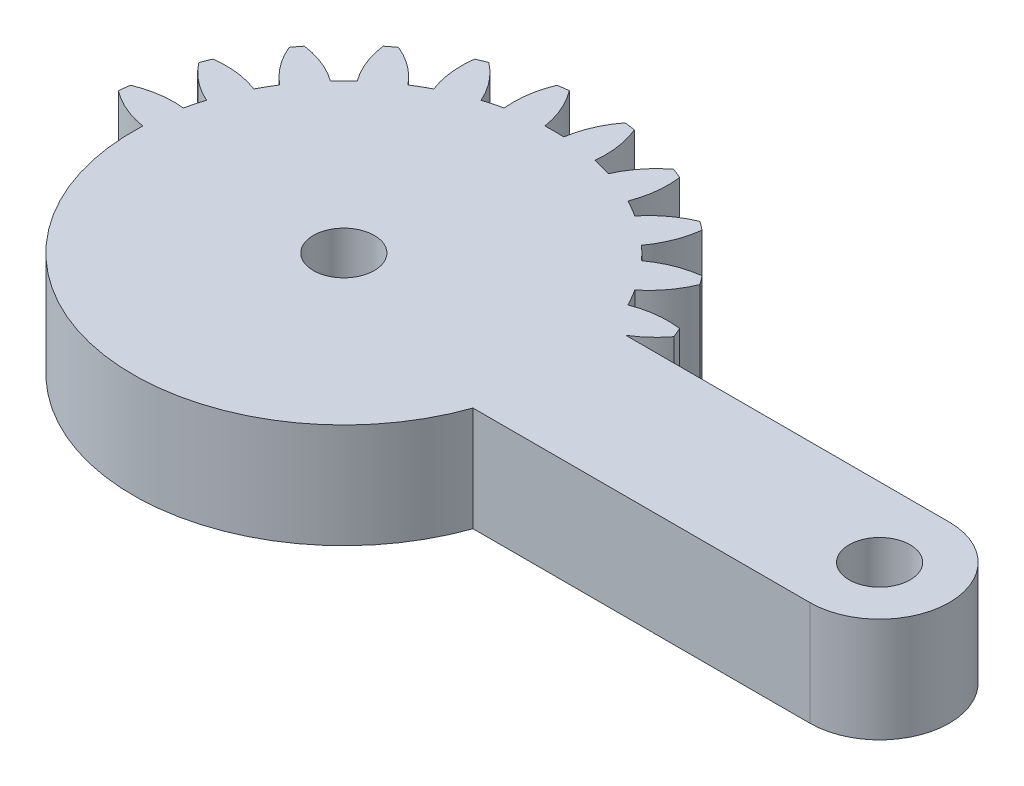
from build123d import *
from build123d.topology import SkipClean

# Parameters (mm, degrees)
SKETCH1_R           = 1.75
BOSS_EXTRUDE1_DEPTH = 4
CUT_EXTRUDE1_START  = -10
CUT_EXTRUDE1_DEPTH  = 10
MOVE_FACE1_BY       = 2


with BuildPart() as part:
    # Sketch1 → Boss-Extrude1 (new body)
    with BuildSketch(Plane(origin=(0, 0, 0), x_dir=(1, 0, 0), z_dir=(0, 1, 0))):
        with BuildLine():
            Line((20.643657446, 4), (2.081641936, 4))
            ThreePointArc((2.081641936, 4), (2.861028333, 4.588201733), (3.521749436, 5.30713988))
            ThreePointArc((3.521749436, 5.30713988), (3.405395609, 5.596745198), (3.282888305, 5.883801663))
            ThreePointArc((3.282888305, 5.883801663), (1.93527598, 5.894040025), (0.627094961, 5.57027124))
            ThreePointArc((0.627094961, 5.57027124), (0.366286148, 6.046375), (0.084372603, 6.510293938))
            ThreePointArc((0.084372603, 6.510293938), (1.018855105, 7.48132754), (1.683794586, 8.65351323))
            ThreePointArc((1.683794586, 8.65351323), (1.496450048, 8.903135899), (1.303821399, 9.148703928))
            ThreePointArc((1.303821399, 9.148703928), (-0.000522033, 8.809805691), (-1.180330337, 8.158486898))
            ThreePointArc((-1.180330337, 8.158486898), (-1.555477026, 8.550865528), (-1.947855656, 8.926012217))
            ThreePointArc((-1.947855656, 8.926012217), (-1.296536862, 10.105820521), (-0.957638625, 11.410163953))
            ThreePointArc((-0.957638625, 11.410163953), (-1.203206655, 11.602792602), (-1.452829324, 11.79013714))
            ThreePointArc((-1.452829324, 11.79013714), (-2.625015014, 11.125197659), (-3.596048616, 10.190715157))
            ThreePointArc((-3.596048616, 10.190715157), (-4.059967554, 10.472628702), (-4.536071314, 10.733437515))
            ThreePointArc((-4.536071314, 10.733437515), (-4.212302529, 12.041618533), (-4.222540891, 13.389230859))
            ThreePointArc((-4.222540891, 13.389230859), (-4.509597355, 13.511738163), (-4.799202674, 13.62809199))
            ThreePointArc((-4.799202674, 13.62809199), (-5.759348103, 12.682425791), (-6.455432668, 11.528463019))
            ThreePointArc((-6.455432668, 11.528463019), (-6.976508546, 11.680699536), (-7.503891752, 11.809396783))
            ThreePointArc((-7.503891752, 11.809396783), (-7.529737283, 13.156800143), (-7.888414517, 14.455843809))
            ThreePointArc((-7.888414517, 14.455843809), (-8.197396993, 14.499881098), (-8.507248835, 14.537314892))
            ThreePointArc((-8.507248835, 14.537314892), (-9.18992168, 13.375367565), (-9.563620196, 12.080565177))
            ThreePointArc((-9.563620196, 12.080565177), (-10.106342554, 12.09275), (-10.649064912, 12.080565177))
            ThreePointArc((-10.649064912, 12.080565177), (-11.022763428, 13.375367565), (-11.705436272, 14.537314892))
            ThreePointArc((-11.705436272, 14.537314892), (-12.015288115, 14.499881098), (-12.324270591, 14.455843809))
            ThreePointArc((-12.324270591, 14.455843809), (-12.682947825, 13.156800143), (-12.708793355, 11.809396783))
            ThreePointArc((-12.708793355, 11.809396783), (-13.236176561, 11.680699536), (-13.757252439, 11.528463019))
            ThreePointArc((-13.757252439, 11.528463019), (-14.453337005, 12.682425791), (-15.413482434, 13.62809199))
            ThreePointArc((-15.413482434, 13.62809199), (-15.703087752, 13.511738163), (-15.990144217, 13.389230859))
            ThreePointArc((-15.990144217, 13.389230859), (-16.000382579, 12.041618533), (-15.676613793, 10.733437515))
            ThreePointArc((-15.676613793, 10.733437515), (-16.152717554, 10.472628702), (-16.616636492, 10.190715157))
            ThreePointArc((-16.616636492, 10.190715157), (-17.587670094, 11.125197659), (-18.759855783, 11.79013714))
            ThreePointArc((-18.759855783, 11.79013714), (-19.009478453, 11.602792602), (-19.255046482, 11.410163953))
            ThreePointArc((-19.255046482, 11.410163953), (-18.916148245, 10.105820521), (-18.264829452, 8.926012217))
            ThreePointArc((-18.264829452, 8.926012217), (-18.657208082, 8.550865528), (-19.032354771, 8.158486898))
            ThreePointArc((-19.032354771, 8.158486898), (-20.212163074, 8.809805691), (-21.516506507, 9.148703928))
            ThreePointArc((-21.516506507, 9.148703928), (-21.709135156, 8.903135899), (-21.896479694, 8.65351323))
            ThreePointArc((-21.896479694, 8.65351323), (-21.231540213, 7.48132754), (-20.297057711, 6.510293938))
            ThreePointArc((-20.297057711, 6.510293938), (-20.578971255, 6.046375), (-20.839780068, 5.57027124))
            ThreePointArc((-20.839780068, 5.57027124), (-22.147961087, 5.894040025), (-23.495573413, 5.883801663))
            ThreePointArc((-23.495573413, 5.883801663), (-23.618080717, 5.596745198), (-23.734434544, 5.30713988))
            ThreePointArc((-23.734434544, 5.30713988), (-22.788768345, 4.346994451), (-21.634805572, 3.650909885))
            ThreePointArc((-21.634805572, 3.650909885), (-21.78704209, 3.129834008), (-21.915739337, 2.602450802))
            ThreePointArc((-21.915739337, 2.602450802), (-23.263142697, 2.576605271), (-24.562186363, 2.217928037))
            ThreePointArc((-24.562186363, 2.217928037), (-24.606223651, 1.908945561), (-24.643657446, 1.599093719))
            ThreePointArc((-24.643657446, 1.599093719), (-23.481710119, 0.916420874), (-22.186907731, 0.542722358))
            ThreePointArc((-22.186907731, 0.542722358), (-22.199092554, 0), (-22.186907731, -0.542722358))
            ThreePointArc((-22.186907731, -0.542722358), (-23.481710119, -0.916420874), (-24.643657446, -1.599093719))
            ThreePointArc((-24.643657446, -1.599093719), (-24.606223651, -1.908945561), (-24.562186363, -2.217928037))
            ThreePointArc((-24.562186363, -2.217928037), (-23.263142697, -2.576605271), (-21.915739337, -2.602450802))
            ThreePointArc((-21.915739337, -2.602450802), (-21.78704209, -3.129834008), (-21.634805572, -3.650909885))
            ThreePointArc((-21.634805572, -3.650909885), (-22.788768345, -4.346994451), (-23.734434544, -5.30713988))
            ThreePointArc((-23.734434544, -5.30713988), (-23.618080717, -5.596745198), (-23.495573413, -5.883801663))
            ThreePointArc((-23.495573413, -5.883801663), (-22.147961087, -5.894040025), (-20.839780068, -5.57027124))
            ThreePointArc((-20.839780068, -5.57027124), (-20.578971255, -6.046375), (-20.297057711, -6.510293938))
            ThreePointArc((-20.297057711, -6.510293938), (-21.231540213, -7.48132754), (-21.896479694, -8.65351323))
            ThreePointArc((-21.896479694, -8.65351323), (-21.709135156, -8.903135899), (-21.516506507, -9.148703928))
            ThreePointArc((-21.516506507, -9.148703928), (-20.212163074, -8.809805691), (-19.032354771, -8.158486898))
            ThreePointArc((-19.032354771, -8.158486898), (-18.657208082, -8.550865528), (-18.264829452, -8.926012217))
            ThreePointArc((-18.264829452, -8.926012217), (-18.916148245, -10.105820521), (-19.255046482, -11.410163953))
            ThreePointArc((-19.255046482, -11.410163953), (-19.009478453, -11.602792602), (-18.759855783, -11.79013714))
            ThreePointArc((-18.759855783, -11.79013714), (-17.587670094, -11.125197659), (-16.616636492, -10.190715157))
            ThreePointArc((-16.616636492, -10.190715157), (-16.152717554, -10.472628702), (-15.676613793, -10.733437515))
            ThreePointArc((-15.676613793, -10.733437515), (-16.000382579, -12.041618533), (-15.990144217, -13.389230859))
            ThreePointArc((-15.990144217, -13.389230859), (-15.703087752, -13.511738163), (-15.413482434, -13.62809199))
            ThreePointArc((-15.413482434, -13.62809199), (-14.453337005, -12.682425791), (-13.757252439, -11.528463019))
            ThreePointArc((-13.757252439, -11.528463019), (-13.236176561, -11.680699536), (-12.708793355, -11.809396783))
            ThreePointArc((-12.708793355, -11.809396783), (-12.682947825, -13.156800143), (-12.324270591, -14.455843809))
            ThreePointArc((-12.324270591, -14.455843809), (-12.015288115, -14.499881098), (-11.705436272, -14.537314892))
            ThreePointArc((-11.705436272, -14.537314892), (-11.022763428, -13.375367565), (-10.649064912, -12.080565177))
            ThreePointArc((-10.649064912, -12.080565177), (-10.106342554, -12.09275), (-9.563620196, -12.080565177))
            ThreePointArc((-9.563620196, -12.080565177), (-9.18992168, -13.375367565), (-8.507248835, -14.537314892))
            ThreePointArc((-8.507248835, -14.537314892), (-8.197396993, -14.499881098), (-7.888414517, -14.455843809))
            ThreePointArc((-7.888414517, -14.455843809), (-7.529737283, -13.156800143), (-7.503891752, -11.809396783))
            ThreePointArc((-7.503891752, -11.809396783), (-6.976508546, -11.680699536), (-6.455432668, -11.528463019))
            ThreePointArc((-6.455432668, -11.528463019), (-5.759348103, -12.682425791), (-4.799202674, -13.62809199))
            ThreePointArc((-4.799202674, -13.62809199), (-4.509597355, -13.511738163), (-4.222540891, -13.389230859))
            ThreePointArc((-4.222540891, -13.389230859), (-4.212302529, -12.041618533), (-4.536071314, -10.733437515))
            ThreePointArc((-4.536071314, -10.733437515), (-4.059967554, -10.472628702), (-3.596048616, -10.190715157))
            ThreePointArc((-3.596048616, -10.190715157), (-2.625015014, -11.125197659), (-1.452829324, -11.79013714))
            ThreePointArc((-1.452829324, -11.79013714), (-1.203206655, -11.602792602), (-0.957638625, -11.410163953))
            ThreePointArc((-0.957638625, -11.410163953), (-1.296536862, -10.105820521), (-1.947855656, -8.926012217))
            ThreePointArc((-1.947855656, -8.926012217), (-1.555477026, -8.550865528), (-1.180330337, -8.158486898))
            ThreePointArc((-1.180330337, -8.158486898), (-0.000522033, -8.809805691), (1.303821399, -9.148703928))
            ThreePointArc((1.303821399, -9.148703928), (1.496450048, -8.903135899), (1.683794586, -8.65351323))
            ThreePointArc((1.683794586, -8.65351323), (1.018855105, -7.48132754), (0.084372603, -6.510293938))
            ThreePointArc((0.084372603, -6.510293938), (0.366286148, -6.046375), (0.627094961, -5.57027124))
            ThreePointArc((0.627094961, -5.57027124), (1.93527598, -5.894040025), (3.282888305, -5.883801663))
            ThreePointArc((3.282888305, -5.883801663), (3.405395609, -5.596745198), (3.521749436, -5.30713988))
            ThreePointArc((3.521749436, -5.30713988), (2.861028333, -4.588201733), (2.081641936, -4))
            Line((2.081641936, -4), (20.643657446, -4))
            ThreePointArc((20.643657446, -4), (24.643657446, 0), (20.643657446, 4))
        make_face()
        with Locations(Location((-10.106342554, 0, 0), (0, 0, 270))):
            Circle(SKETCH1_R, mode=Mode.SUBTRACT)
        with Locations(Location((20.643657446, 0, 0), (0, 0, 270))):
            Circle(SKETCH1_R, mode=Mode.SUBTRACT)
    extrude(amount=BOSS_EXTRUDE1_DEPTH)

    # Sketch2 → Cut-Extrude1 (cut)
    with SkipClean():  # the faces are left unmerged after this step: merging them gives an invalid solid
        with BuildSketch(Plane(origin=(0, 4, 0), x_dir=(1, 0, 0), z_dir=(0, 1, 0)).offset(CUT_EXTRUDE1_START)):
            with BuildLine():
                ThreePointArc((-24.562186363, -2.217928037), (-23.263142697, -2.576605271), (-21.915739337, -2.602450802))
                ThreePointArc((-21.915739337, -2.602450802), (-22.095637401, -1.578420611), (-22.186907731, -0.542722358))
                ThreePointArc((-22.186907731, -0.542722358), (-23.481710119, -0.916420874), (-24.643657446, -1.599093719))
                ThreePointArc((-24.643657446, -1.599093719), (-24.606223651, -1.908945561), (-24.562186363, -2.217928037))
            make_face()
            with BuildLine():
                ThreePointArc((-23.495573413, -5.883801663), (-22.147961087, -5.894040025), (-20.839780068, -5.57027124))
                ThreePointArc((-20.839780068, -5.57027124), (-21.278586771, -4.627695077), (-21.634805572, -3.650909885))
                ThreePointArc((-21.634805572, -3.650909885), (-22.788768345, -4.346994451), (-23.734434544, -5.30713988))
                ThreePointArc((-23.734434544, -5.30713988), (-23.618080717, -5.596745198), (-23.495573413, -5.883801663))
            make_face()
            with BuildLine():
                ThreePointArc((-21.516506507, -9.148703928), (-20.212163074, -8.809805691), (-19.032354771, -8.158486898))
                ThreePointArc((-19.032354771, -8.158486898), (-19.70016616, -7.361599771), (-20.297057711, -6.510293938))
                ThreePointArc((-20.297057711, -6.510293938), (-21.231540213, -7.48132754), (-21.896479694, -8.65351323))
                ThreePointArc((-21.896479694, -8.65351323), (-21.709135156, -8.903135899), (-21.516506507, -9.148703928))
            make_face()
            with BuildLine():
                ThreePointArc((-18.759855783, -11.79013714), (-17.587670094, -11.125197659), (-16.616636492, -10.190715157))
                ThreePointArc((-16.616636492, -10.190715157), (-17.467942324, -9.593823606), (-18.264829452, -8.926012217))
                ThreePointArc((-18.264829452, -8.926012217), (-18.916148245, -10.105820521), (-19.255046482, -11.410163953))
                ThreePointArc((-19.255046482, -11.410163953), (-19.009478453, -11.602792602), (-18.759855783, -11.79013714))
            make_face()
            with BuildLine():
                ThreePointArc((-15.413482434, -13.62809199), (-14.453337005, -12.682425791), (-13.757252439, -11.528463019))
                ThreePointArc((-13.757252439, -11.528463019), (-14.734037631, -11.172244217), (-15.676613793, -10.733437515))
                ThreePointArc((-15.676613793, -10.733437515), (-16.000382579, -12.041618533), (-15.990144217, -13.389230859))
                ThreePointArc((-15.990144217, -13.389230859), (-15.703087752, -13.511738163), (-15.413482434, -13.62809199))
            make_face()
            with BuildLine():
                ThreePointArc((-11.705436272, -14.537314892), (-11.022763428, -13.375367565), (-10.649064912, -12.080565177))
                ThreePointArc((-10.649064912, -12.080565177), (-11.684763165, -11.989294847), (-12.708793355, -11.809396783))
                ThreePointArc((-12.708793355, -11.809396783), (-12.682947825, -13.156800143), (-12.324270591, -14.455843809))
                ThreePointArc((-12.324270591, -14.455843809), (-12.015288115, -14.499881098), (-11.705436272, -14.537314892))
            make_face()
            with BuildLine():
                ThreePointArc((-7.888414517, -14.455843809), (-7.529737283, -13.156800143), (-7.503891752, -11.809396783))
                ThreePointArc((-7.503891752, -11.809396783), (-8.527921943, -11.989294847), (-9.563620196, -12.080565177))
                ThreePointArc((-9.563620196, -12.080565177), (-9.18992168, -13.375367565), (-8.507248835, -14.537314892))
                ThreePointArc((-8.507248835, -14.537314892), (-8.197396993, -14.499881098), (-7.888414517, -14.455843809))
            make_face()
            with BuildLine():
                ThreePointArc((-4.222540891, -13.389230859), (-4.212302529, -12.041618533), (-4.536071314, -10.733437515))
                ThreePointArc((-4.536071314, -10.733437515), (-5.478647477, -11.172244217), (-6.455432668, -11.528463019))
                ThreePointArc((-6.455432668, -11.528463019), (-5.759348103, -12.682425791), (-4.799202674, -13.62809199))
                ThreePointArc((-4.799202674, -13.62809199), (-4.509597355, -13.511738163), (-4.222540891, -13.389230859))
            make_face()
            with BuildLine():
                ThreePointArc((-0.957638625, -11.410163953), (-1.296536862, -10.105820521), (-1.947855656, -8.926012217))
                ThreePointArc((-1.947855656, -8.926012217), (-2.744742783, -9.593823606), (-3.596048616, -10.190715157))
                ThreePointArc((-3.596048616, -10.190715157), (-2.625015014, -11.125197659), (-1.452829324, -11.79013714))
                ThreePointArc((-1.452829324, -11.79013714), (-1.203206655, -11.602792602), (-0.957638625, -11.410163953))
            make_face()
            with BuildLine():
                ThreePointArc((1.683794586, -8.65351323), (1.018855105, -7.48132754), (0.084372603, -6.510293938))
                ThreePointArc((0.084372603, -6.510293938), (-0.512518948, -7.361599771), (-1.180330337, -8.158486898))
                ThreePointArc((-1.180330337, -8.158486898), (-0.000522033, -8.809805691), (1.303821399, -9.148703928))
                ThreePointArc((1.303821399, -9.148703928), (1.496450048, -8.903135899), (1.683794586, -8.65351323))
            make_face()
            with BuildLine():
                ThreePointArc((3.521749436, -5.30713988), (2.861028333, -4.588201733), (2.081641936, -4))
                Line((2.081641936, -4), (1.305695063, -4))
                ThreePointArc((1.305695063, -4), (0.994195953, -4.797149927), (0.627094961, -5.57027124))
                ThreePointArc((0.627094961, -5.57027124), (1.93527598, -5.894040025), (3.282888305, -5.883801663))
                ThreePointArc((3.282888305, -5.883801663), (3.405395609, -5.596745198), (3.521749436, -5.30713988))
            make_face()
        extrude(amount=CUT_EXTRUDE1_DEPTH, mode=Mode.SUBTRACT)

    # Move Face1: a face moved outward by 2.0
    extrude(part.faces().sort_by_distance((-4.527591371, 0, -0.601969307))[0], amount=MOVE_FACE1_BY, dir=(0, -1, 0))


solid = part.part
